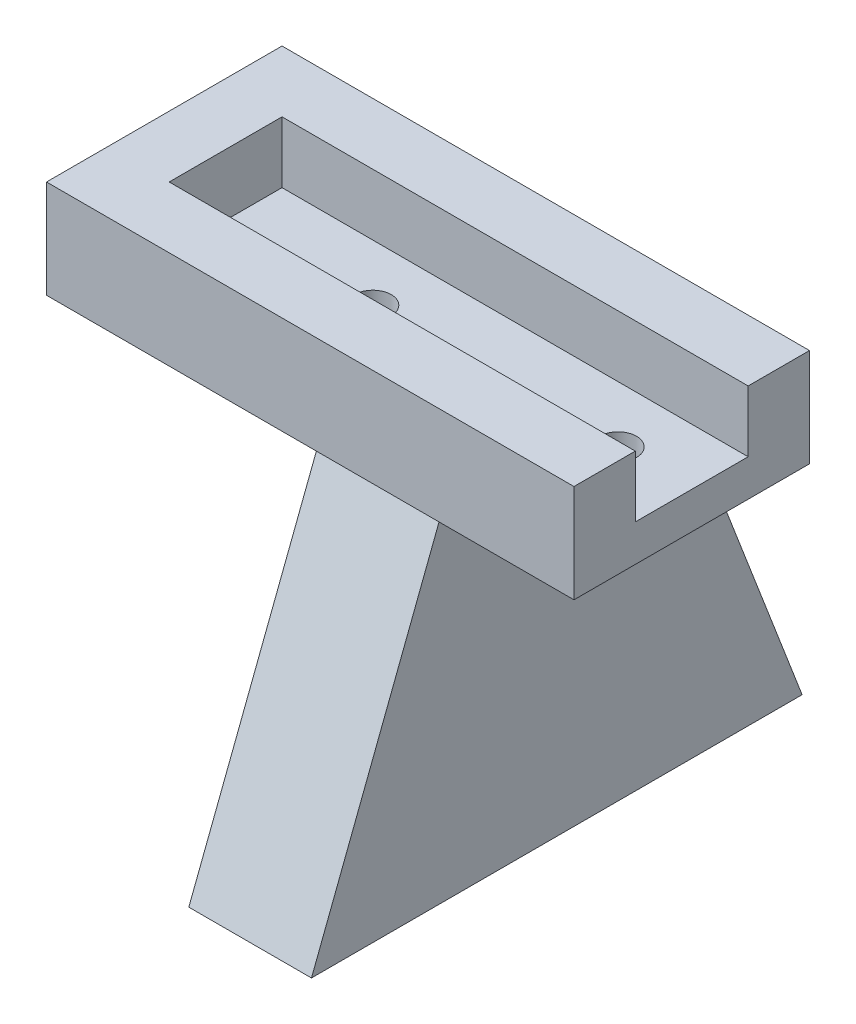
ISO-10303-21;
HEADER;
FILE_DESCRIPTION(('STEP AP214'),'2;1');
FILE_NAME('part.step','',(''),(''),'','','');
FILE_SCHEMA(('AUTOMOTIVE_DESIGN { 1 0 10303 214 1 1 1 1 }'));
ENDSEC;
DATA;
#1=APPLICATION_CONTEXT('core data for automotive mechanical design processes');
#2=APPLICATION_PROTOCOL_DEFINITION('international standard','automotive_design',2000,#1);
#3=PRODUCT_CONTEXT('',#1,'mechanical');
#4=PRODUCT('Part','Part','',(#3));
#5=PRODUCT_RELATED_PRODUCT_CATEGORY('part','',(#4));
#6=PRODUCT_DEFINITION_FORMATION('','',#4);
#7=PRODUCT_DEFINITION_CONTEXT('part definition',#1,'design');
#8=PRODUCT_DEFINITION('design','',#6,#7);
#9=PRODUCT_DEFINITION_SHAPE('','',#8);
#10=(LENGTH_UNIT() NAMED_UNIT(*) SI_UNIT(.MILLI.,.METRE.));
#11=(NAMED_UNIT(*) PLANE_ANGLE_UNIT() SI_UNIT($,.RADIAN.));
#12=(NAMED_UNIT(*) SI_UNIT($,.STERADIAN.) SOLID_ANGLE_UNIT());
#13=UNCERTAINTY_MEASURE_WITH_UNIT(LENGTH_MEASURE(1.E-05),#10,'distance_accuracy_value','');
#14=(GEOMETRIC_REPRESENTATION_CONTEXT(3) GLOBAL_UNCERTAINTY_ASSIGNED_CONTEXT((#13)) GLOBAL_UNIT_ASSIGNED_CONTEXT((#10,
#11,#12)) REPRESENTATION_CONTEXT('',''));
#15=CARTESIAN_POINT('',(0.,0.,0.));
#16=DIRECTION('',(0.,0.,1.));
#17=DIRECTION('',(1.,0.,0.));
#18=AXIS2_PLACEMENT_3D('',#15,#16,#17);
#19=CARTESIAN_POINT('',(-12.,-3.,9.6));
#20=DIRECTION('',(0.,-1.,0.));
#21=DIRECTION('',(0.,0.,-1.));
#22=AXIS2_PLACEMENT_3D('',#19,#20,#21);
#23=PLANE('',#22);
#24=CARTESIAN_POINT('',(0.,-3.,0.));
#25=DIRECTION('',(0.,1.,0.));
#26=DIRECTION('',(0.,0.,1.));
#27=AXIS2_PLACEMENT_3D('',#24,#25,#26);
#28=CIRCLE('',#27,1.5);
#29=CARTESIAN_POINT('',(0.,-3.,1.5));
#30=VERTEX_POINT('',#29);
#31=EDGE_CURVE('E207',#30,#30,#28,.T.);
#32=ORIENTED_EDGE('',*,*,#31,.T.);
#33=EDGE_LOOP('',(#32));
#34=FACE_BOUND('',#33,.T.);
#35=DIRECTION('',(1.,0.,0.));
#36=VECTOR('',#35,1.);
#37=CARTESIAN_POINT('',(-12.,-3.,-9.6));
#38=LINE('',#37,#36);
#39=CARTESIAN_POINT('',(-17.,-3.,-9.6));
#40=VERTEX_POINT('',#39);
#41=CARTESIAN_POINT('',(5.,-3.,-9.6));
#42=VERTEX_POINT('',#41);
#43=EDGE_CURVE('E135',#40,#42,#38,.T.);
#44=ORIENTED_EDGE('',*,*,#43,.T.);
#45=DIRECTION('',(0.,0.,1.));
#46=VECTOR('',#45,1.);
#47=CARTESIAN_POINT('',(5.,-3.,9.6));
#48=LINE('',#47,#46);
#49=CARTESIAN_POINT('',(5.,-3.,9.6));
#50=VERTEX_POINT('',#49);
#51=EDGE_CURVE('E61',#42,#50,#48,.T.);
#52=ORIENTED_EDGE('',*,*,#51,.T.);
#53=DIRECTION('',(1.,0.,0.));
#54=VECTOR('',#53,1.);
#55=CARTESIAN_POINT('',(-12.,-3.,9.6));
#56=LINE('',#55,#54);
#57=CARTESIAN_POINT('',(-17.,-3.,9.6));
#58=VERTEX_POINT('',#57);
#59=EDGE_CURVE('E47',#58,#50,#56,.T.);
#60=ORIENTED_EDGE('',*,*,#59,.F.);
#61=DIRECTION('',(0.,0.,1.));
#62=VECTOR('',#61,1.);
#63=CARTESIAN_POINT('',(-17.,-3.,9.6));
#64=LINE('',#63,#62);
#65=EDGE_CURVE('E147',#40,#58,#64,.T.);
#66=ORIENTED_EDGE('',*,*,#65,.F.);
#67=EDGE_LOOP('',(#44,#52,#60,#66));
#68=FACE_BOUND('',#67,.T.);
#69=ADVANCED_FACE('F43',(#34,#68),#23,.T.);
#70=CARTESIAN_POINT('',(-12.,5.,9.6));
#71=DIRECTION('',(0.,0.,1.));
#72=DIRECTION('',(0.,-1.,0.));
#73=AXIS2_PLACEMENT_3D('',#70,#71,#72);
#74=PLANE('',#73);
#75=ORIENTED_EDGE('',*,*,#59,.T.);
#76=DIRECTION('',(-1.,0.,0.));
#77=VECTOR('',#76,1.);
#78=CARTESIAN_POINT('',(15.,-3.,9.6));
#79=LINE('',#78,#77);
#80=CARTESIAN_POINT('',(15.,-3.,9.6));
#81=VERTEX_POINT('',#80);
#82=EDGE_CURVE('E202',#81,#50,#79,.T.);
#83=ORIENTED_EDGE('',*,*,#82,.F.);
#84=CARTESIAN_POINT('',(26.,-3.,9.6));
#85=VERTEX_POINT('',#84);
#86=EDGE_CURVE('E265',#81,#85,#56,.T.);
#87=ORIENTED_EDGE('',*,*,#86,.T.);
#88=DIRECTION('',(0.,-1.,0.));
#89=VECTOR('',#88,1.);
#90=CARTESIAN_POINT('',(26.,5.,9.6));
#91=LINE('',#90,#89);
#92=CARTESIAN_POINT('',(26.,5.,9.6));
#93=VERTEX_POINT('',#92);
#94=EDGE_CURVE('E222',#93,#85,#91,.T.);
#95=ORIENTED_EDGE('',*,*,#94,.F.);
#96=DIRECTION('',(1.,0.,0.));
#97=VECTOR('',#96,1.);
#98=CARTESIAN_POINT('',(-12.,5.,9.6));
#99=LINE('',#98,#97);
#100=CARTESIAN_POINT('',(-17.,5.,9.6));
#101=VERTEX_POINT('',#100);
#102=EDGE_CURVE('E11',#101,#93,#99,.T.);
#103=ORIENTED_EDGE('',*,*,#102,.F.);
#104=DIRECTION('',(0.,1.,0.));
#105=VECTOR('',#104,1.);
#106=CARTESIAN_POINT('',(-17.,5.,9.6));
#107=LINE('',#106,#105);
#108=EDGE_CURVE('E152',#58,#101,#107,.T.);
#109=ORIENTED_EDGE('',*,*,#108,.F.);
#110=EDGE_LOOP('',(#75,#83,#87,#95,#103,#109));
#111=FACE_BOUND('',#110,.T.);
#112=ADVANCED_FACE('F45',(#111),#74,.T.);
#113=CARTESIAN_POINT('',(-12.,5.,4.6));
#114=DIRECTION('',(0.,1.,0.));
#115=DIRECTION('',(0.,0.,1.));
#116=AXIS2_PLACEMENT_3D('',#113,#114,#115);
#117=PLANE('',#116);
#118=ORIENTED_EDGE('',*,*,#102,.T.);
#119=DIRECTION('',(0.,0.,1.));
#120=VECTOR('',#119,1.);
#121=CARTESIAN_POINT('',(26.,5.,4.6));
#122=LINE('',#121,#120);
#123=CARTESIAN_POINT('',(26.,5.,4.6));
#124=VERTEX_POINT('',#123);
#125=EDGE_CURVE('E250',#124,#93,#122,.T.);
#126=ORIENTED_EDGE('',*,*,#125,.F.);
#127=DIRECTION('',(1.,0.,0.));
#128=VECTOR('',#127,1.);
#129=CARTESIAN_POINT('',(-12.,5.,4.6));
#130=LINE('',#129,#128);
#131=CARTESIAN_POINT('',(-12.,5.,4.6));
#132=VERTEX_POINT('',#131);
#133=EDGE_CURVE('E53',#132,#124,#130,.T.);
#134=ORIENTED_EDGE('',*,*,#133,.F.);
#135=DIRECTION('',(0.,0.,-1.));
#136=VECTOR('',#135,1.);
#137=CARTESIAN_POINT('',(-12.,5.,-9.6));
#138=LINE('',#137,#136);
#139=CARTESIAN_POINT('',(-12.,5.,-4.6));
#140=VERTEX_POINT('',#139);
#141=EDGE_CURVE('E159',#132,#140,#138,.T.);
#142=ORIENTED_EDGE('',*,*,#141,.T.);
#143=DIRECTION('',(1.,0.,0.));
#144=VECTOR('',#143,1.);
#145=CARTESIAN_POINT('',(-12.,5.,-4.6));
#146=LINE('',#145,#144);
#147=CARTESIAN_POINT('',(26.,5.,-4.6));
#148=VERTEX_POINT('',#147);
#149=EDGE_CURVE('E275',#140,#148,#146,.T.);
#150=ORIENTED_EDGE('',*,*,#149,.T.);
#151=DIRECTION('',(0.,0.,1.));
#152=VECTOR('',#151,1.);
#153=CARTESIAN_POINT('',(26.,5.,-4.6));
#154=LINE('',#153,#152);
#155=CARTESIAN_POINT('',(26.,5.,-9.6));
#156=VERTEX_POINT('',#155);
#157=EDGE_CURVE('E234',#156,#148,#154,.T.);
#158=ORIENTED_EDGE('',*,*,#157,.F.);
#159=DIRECTION('',(1.,0.,0.));
#160=VECTOR('',#159,1.);
#161=CARTESIAN_POINT('',(-12.,5.,-9.6));
#162=LINE('',#161,#160);
#163=CARTESIAN_POINT('',(-17.,5.,-9.6));
#164=VERTEX_POINT('',#163);
#165=EDGE_CURVE('E144',#164,#156,#162,.T.);
#166=ORIENTED_EDGE('',*,*,#165,.F.);
#167=DIRECTION('',(0.,0.,-1.));
#168=VECTOR('',#167,1.);
#169=CARTESIAN_POINT('',(-17.,5.,-9.6));
#170=LINE('',#169,#168);
#171=EDGE_CURVE('E157',#101,#164,#170,.T.);
#172=ORIENTED_EDGE('',*,*,#171,.F.);
#173=EDGE_LOOP('',(#118,#126,#134,#142,#150,#158,#166,#172));
#174=FACE_BOUND('',#173,.T.);
#175=ADVANCED_FACE('F286',(#174),#117,.T.);
#176=CARTESIAN_POINT('',(-12.,0.,4.6));
#177=DIRECTION('',(0.,0.,-1.));
#178=DIRECTION('',(-1.,0.,0.));
#179=AXIS2_PLACEMENT_3D('',#176,#177,#178);
#180=PLANE('',#179);
#181=ORIENTED_EDGE('',*,*,#133,.T.);
#182=DIRECTION('',(0.,1.,0.));
#183=VECTOR('',#182,1.);
#184=CARTESIAN_POINT('',(26.,0.,4.6));
#185=LINE('',#184,#183);
#186=CARTESIAN_POINT('',(26.,0.,4.6));
#187=VERTEX_POINT('',#186);
#188=EDGE_CURVE('E246',#187,#124,#185,.T.);
#189=ORIENTED_EDGE('',*,*,#188,.F.);
#190=DIRECTION('',(1.,0.,0.));
#191=VECTOR('',#190,1.);
#192=CARTESIAN_POINT('',(-12.,0.,4.6));
#193=LINE('',#192,#191);
#194=CARTESIAN_POINT('',(-12.,0.,4.6));
#195=VERTEX_POINT('',#194);
#196=EDGE_CURVE('E269',#195,#187,#193,.T.);
#197=ORIENTED_EDGE('',*,*,#196,.F.);
#198=DIRECTION('',(0.,1.,0.));
#199=VECTOR('',#198,1.);
#200=CARTESIAN_POINT('',(-12.,0.,4.6));
#201=LINE('',#200,#199);
#202=EDGE_CURVE('E262',#195,#132,#201,.T.);
#203=ORIENTED_EDGE('',*,*,#202,.T.);
#204=EDGE_LOOP('',(#181,#189,#197,#203));
#205=FACE_BOUND('',#204,.T.);
#206=ADVANCED_FACE('F298',(#205),#180,.T.);
#207=CARTESIAN_POINT('',(-12.,0.,4.6));
#208=DIRECTION('',(0.,1.,0.));
#209=DIRECTION('',(0.,0.,1.));
#210=AXIS2_PLACEMENT_3D('',#207,#208,#209);
#211=PLANE('',#210);
#212=CARTESIAN_POINT('',(0.,0.,0.));
#213=DIRECTION('',(0.,1.,0.));
#214=DIRECTION('',(0.,0.,1.));
#215=AXIS2_PLACEMENT_3D('',#212,#213,#214);
#216=CIRCLE('',#215,1.5);
#217=CARTESIAN_POINT('',(0.,0.,1.5));
#218=VERTEX_POINT('',#217);
#219=EDGE_CURVE('E218',#218,#218,#216,.T.);
#220=ORIENTED_EDGE('',*,*,#219,.F.);
#221=EDGE_LOOP('',(#220));
#222=FACE_BOUND('',#221,.T.);
#223=CARTESIAN_POINT('',(20.,0.,0.));
#224=DIRECTION('',(0.,1.,0.));
#225=DIRECTION('',(0.,0.,1.));
#226=AXIS2_PLACEMENT_3D('',#223,#224,#225);
#227=CIRCLE('',#226,1.5);
#228=CARTESIAN_POINT('',(20.,0.,1.5));
#229=VERTEX_POINT('',#228);
#230=EDGE_CURVE('E211',#229,#229,#227,.T.);
#231=ORIENTED_EDGE('',*,*,#230,.F.);
#232=EDGE_LOOP('',(#231));
#233=FACE_BOUND('',#232,.T.);
#234=ORIENTED_EDGE('',*,*,#196,.T.);
#235=DIRECTION('',(0.,0.,1.));
#236=VECTOR('',#235,1.);
#237=CARTESIAN_POINT('',(26.,0.,4.6));
#238=LINE('',#237,#236);
#239=CARTESIAN_POINT('',(26.,0.,-4.6));
#240=VERTEX_POINT('',#239);
#241=EDGE_CURVE('E242',#240,#187,#238,.T.);
#242=ORIENTED_EDGE('',*,*,#241,.F.);
#243=DIRECTION('',(1.,0.,0.));
#244=VECTOR('',#243,1.);
#245=CARTESIAN_POINT('',(-12.,0.,-4.6));
#246=LINE('',#245,#244);
#247=CARTESIAN_POINT('',(-12.,0.,-4.6));
#248=VERTEX_POINT('',#247);
#249=EDGE_CURVE('E272',#248,#240,#246,.T.);
#250=ORIENTED_EDGE('',*,*,#249,.F.);
#251=DIRECTION('',(0.,0.,1.));
#252=VECTOR('',#251,1.);
#253=CARTESIAN_POINT('',(-12.,0.,4.6));
#254=LINE('',#253,#252);
#255=EDGE_CURVE('E258',#248,#195,#254,.T.);
#256=ORIENTED_EDGE('',*,*,#255,.T.);
#257=EDGE_LOOP('',(#234,#242,#250,#256));
#258=FACE_BOUND('',#257,.T.);
#259=ADVANCED_FACE('F295',(#222,#233,#258),#211,.T.);
#260=CARTESIAN_POINT('',(-12.,0.,-4.6));
#261=DIRECTION('',(0.,0.,1.));
#262=DIRECTION('',(1.,0.,0.));
#263=AXIS2_PLACEMENT_3D('',#260,#261,#262);
#264=PLANE('',#263);
#265=ORIENTED_EDGE('',*,*,#249,.T.);
#266=DIRECTION('',(0.,-1.,0.));
#267=VECTOR('',#266,1.);
#268=CARTESIAN_POINT('',(26.,0.,-4.6));
#269=LINE('',#268,#267);
#270=EDGE_CURVE('E238',#148,#240,#269,.T.);
#271=ORIENTED_EDGE('',*,*,#270,.F.);
#272=ORIENTED_EDGE('',*,*,#149,.F.);
#273=DIRECTION('',(0.,-1.,0.));
#274=VECTOR('',#273,1.);
#275=CARTESIAN_POINT('',(-12.,0.,-4.6));
#276=LINE('',#275,#274);
#277=EDGE_CURVE('E254',#140,#248,#276,.T.);
#278=ORIENTED_EDGE('',*,*,#277,.T.);
#279=EDGE_LOOP('',(#265,#271,#272,#278));
#280=FACE_BOUND('',#279,.T.);
#281=ADVANCED_FACE('F290',(#280),#264,.T.);
#282=CARTESIAN_POINT('',(-12.,-3.,-9.6));
#283=DIRECTION('',(0.,0.,-1.));
#284=DIRECTION('',(-1.,0.,0.));
#285=AXIS2_PLACEMENT_3D('',#282,#283,#284);
#286=PLANE('',#285);
#287=ORIENTED_EDGE('',*,*,#165,.T.);
#288=DIRECTION('',(0.,1.,0.));
#289=VECTOR('',#288,1.);
#290=CARTESIAN_POINT('',(26.,-3.,-9.6));
#291=LINE('',#290,#289);
#292=CARTESIAN_POINT('',(26.,-3.,-9.6));
#293=VERTEX_POINT('',#292);
#294=EDGE_CURVE('E230',#293,#156,#291,.T.);
#295=ORIENTED_EDGE('',*,*,#294,.F.);
#296=CARTESIAN_POINT('',(15.,-3.,-9.6));
#297=VERTEX_POINT('',#296);
#298=EDGE_CURVE('E145',#297,#293,#38,.T.);
#299=ORIENTED_EDGE('',*,*,#298,.F.);
#300=DIRECTION('',(-1.,0.,0.));
#301=VECTOR('',#300,1.);
#302=CARTESIAN_POINT('',(15.,-3.,-9.6));
#303=LINE('',#302,#301);
#304=EDGE_CURVE('E141',#297,#42,#303,.T.);
#305=ORIENTED_EDGE('',*,*,#304,.T.);
#306=ORIENTED_EDGE('',*,*,#43,.F.);
#307=DIRECTION('',(0.,-1.,0.));
#308=VECTOR('',#307,1.);
#309=CARTESIAN_POINT('',(-17.,-3.,-9.6));
#310=LINE('',#309,#308);
#311=EDGE_CURVE('E139',#164,#40,#310,.T.);
#312=ORIENTED_EDGE('',*,*,#311,.F.);
#313=EDGE_LOOP('',(#287,#295,#299,#305,#306,#312));
#314=FACE_BOUND('',#313,.T.);
#315=ADVANCED_FACE('F137',(#314),#286,.T.);
#316=DIRECTION('',(0.,0.,1.));
#317=VECTOR('',#316,1.);
#318=CARTESIAN_POINT('',(15.,-3.,9.6));
#319=LINE('',#318,#317);
#320=EDGE_CURVE('E69',#297,#81,#319,.T.);
#321=ORIENTED_EDGE('',*,*,#320,.F.);
#322=ORIENTED_EDGE('',*,*,#298,.T.);
#323=DIRECTION('',(0.,0.,-1.));
#324=VECTOR('',#323,1.);
#325=CARTESIAN_POINT('',(26.,-3.,9.6));
#326=LINE('',#325,#324);
#327=EDGE_CURVE('E226',#85,#293,#326,.T.);
#328=ORIENTED_EDGE('',*,*,#327,.F.);
#329=ORIENTED_EDGE('',*,*,#86,.F.);
#330=EDGE_LOOP('',(#321,#322,#328,#329));
#331=FACE_BOUND('',#330,.T.);
#332=CARTESIAN_POINT('',(20.,-3.,0.));
#333=DIRECTION('',(0.,1.,0.));
#334=DIRECTION('',(0.,0.,1.));
#335=AXIS2_PLACEMENT_3D('',#332,#333,#334);
#336=CIRCLE('',#335,1.5);
#337=CARTESIAN_POINT('',(20.,-3.,1.5));
#338=VERTEX_POINT('',#337);
#339=EDGE_CURVE('E206',#338,#338,#336,.T.);
#340=ORIENTED_EDGE('',*,*,#339,.T.);
#341=EDGE_LOOP('',(#340));
#342=FACE_BOUND('',#341,.T.);
#343=ADVANCED_FACE('F304',(#331,#342),#23,.T.);
#344=CARTESIAN_POINT('',(26.,0.,0.));
#345=DIRECTION('',(1.,0.,0.));
#346=DIRECTION('',(0.,0.,-1.));
#347=AXIS2_PLACEMENT_3D('',#344,#345,#346);
#348=PLANE('',#347);
#349=ORIENTED_EDGE('',*,*,#94,.T.);
#350=ORIENTED_EDGE('',*,*,#327,.T.);
#351=ORIENTED_EDGE('',*,*,#294,.T.);
#352=ORIENTED_EDGE('',*,*,#157,.T.);
#353=ORIENTED_EDGE('',*,*,#270,.T.);
#354=ORIENTED_EDGE('',*,*,#241,.T.);
#355=ORIENTED_EDGE('',*,*,#188,.T.);
#356=ORIENTED_EDGE('',*,*,#125,.T.);
#357=EDGE_LOOP('',(#349,#350,#351,#352,#353,#354,#355,#356));
#358=FACE_BOUND('',#357,.T.);
#359=ADVANCED_FACE('F283',(#358),#348,.T.);
#360=CARTESIAN_POINT('',(20.,-3.,0.));
#361=DIRECTION('',(0.,1.,0.));
#362=DIRECTION('',(0.,0.,1.));
#363=AXIS2_PLACEMENT_3D('',#360,#361,#362);
#364=CYLINDRICAL_SURFACE('',#363,1.5);
#365=ORIENTED_EDGE('',*,*,#230,.T.);
#366=EDGE_LOOP('',(#365));
#367=FACE_BOUND('',#366,.T.);
#368=ORIENTED_EDGE('',*,*,#339,.F.);
#369=EDGE_LOOP('',(#368));
#370=FACE_BOUND('',#369,.T.);
#371=ADVANCED_FACE('F345',(#367,#370),#364,.F.);
#372=CARTESIAN_POINT('',(0.,-3.,0.));
#373=DIRECTION('',(0.,1.,0.));
#374=DIRECTION('',(0.,0.,1.));
#375=AXIS2_PLACEMENT_3D('',#372,#373,#374);
#376=CYLINDRICAL_SURFACE('',#375,1.5);
#377=ORIENTED_EDGE('',*,*,#219,.T.);
#378=EDGE_LOOP('',(#377));
#379=FACE_BOUND('',#378,.T.);
#380=ORIENTED_EDGE('',*,*,#31,.F.);
#381=EDGE_LOOP('',(#380));
#382=FACE_BOUND('',#381,.T.);
#383=ADVANCED_FACE('F332',(#379,#382),#376,.F.);
#384=CARTESIAN_POINT('',(15.,-30.,20.));
#385=DIRECTION('',(0.,-0.359442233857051,-0.933167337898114));
#386=DIRECTION('',(0.,0.933167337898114,-0.359442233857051));
#387=AXIS2_PLACEMENT_3D('',#384,#385,#386);
#388=PLANE('',#387);
#389=DIRECTION('',(0.,-0.933167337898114,0.359442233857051));
#390=VECTOR('',#389,1.);
#391=CARTESIAN_POINT('',(5.,-30.,20.));
#392=LINE('',#391,#390);
#393=CARTESIAN_POINT('',(5.,-30.,20.));
#394=VERTEX_POINT('',#393);
#395=EDGE_CURVE('E184',#50,#394,#392,.T.);
#396=ORIENTED_EDGE('',*,*,#395,.T.);
#397=DIRECTION('',(-1.,0.,0.));
#398=VECTOR('',#397,1.);
#399=CARTESIAN_POINT('',(15.,-30.,20.));
#400=LINE('',#399,#398);
#401=CARTESIAN_POINT('',(15.,-30.,20.));
#402=VERTEX_POINT('',#401);
#403=EDGE_CURVE('E198',#402,#394,#400,.T.);
#404=ORIENTED_EDGE('',*,*,#403,.F.);
#405=DIRECTION('',(0.,-0.933167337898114,0.359442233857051));
#406=VECTOR('',#405,1.);
#407=CARTESIAN_POINT('',(15.,-30.,20.));
#408=LINE('',#407,#406);
#409=EDGE_CURVE('E171',#81,#402,#408,.T.);
#410=ORIENTED_EDGE('',*,*,#409,.F.);
#411=ORIENTED_EDGE('',*,*,#82,.T.);
#412=EDGE_LOOP('',(#396,#404,#410,#411));
#413=FACE_BOUND('',#412,.T.);
#414=ADVANCED_FACE('F315',(#413),#388,.F.);
#415=CARTESIAN_POINT('',(15.,-30.,20.));
#416=DIRECTION('',(0.,1.,0.));
#417=DIRECTION('',(0.,0.,1.));
#418=AXIS2_PLACEMENT_3D('',#415,#416,#417);
#419=PLANE('',#418);
#420=DIRECTION('',(0.,0.,-1.));
#421=VECTOR('',#420,1.);
#422=CARTESIAN_POINT('',(5.,-30.,20.));
#423=LINE('',#422,#421);
#424=CARTESIAN_POINT('',(5.,-30.,-20.));
#425=VERTEX_POINT('',#424);
#426=EDGE_CURVE('E187',#394,#425,#423,.T.);
#427=ORIENTED_EDGE('',*,*,#426,.T.);
#428=DIRECTION('',(-1.,0.,0.));
#429=VECTOR('',#428,1.);
#430=CARTESIAN_POINT('',(15.,-30.,-20.));
#431=LINE('',#430,#429);
#432=CARTESIAN_POINT('',(15.,-30.,-20.));
#433=VERTEX_POINT('',#432);
#434=EDGE_CURVE('E194',#433,#425,#431,.T.);
#435=ORIENTED_EDGE('',*,*,#434,.F.);
#436=DIRECTION('',(0.,0.,-1.));
#437=VECTOR('',#436,1.);
#438=CARTESIAN_POINT('',(15.,-30.,20.));
#439=LINE('',#438,#437);
#440=EDGE_CURVE('E175',#402,#433,#439,.T.);
#441=ORIENTED_EDGE('',*,*,#440,.F.);
#442=ORIENTED_EDGE('',*,*,#403,.T.);
#443=EDGE_LOOP('',(#427,#435,#441,#442));
#444=FACE_BOUND('',#443,.T.);
#445=ADVANCED_FACE('F324',(#444),#419,.F.);
#446=CARTESIAN_POINT('',(15.,-30.,-20.));
#447=DIRECTION('',(0.,-0.359442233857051,0.933167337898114));
#448=DIRECTION('',(0.,-0.933167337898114,-0.359442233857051));
#449=AXIS2_PLACEMENT_3D('',#446,#447,#448);
#450=PLANE('',#449);
#451=DIRECTION('',(0.,0.933167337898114,0.359442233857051));
#452=VECTOR('',#451,1.);
#453=CARTESIAN_POINT('',(5.,-30.,-20.));
#454=LINE('',#453,#452);
#455=EDGE_CURVE('E172',#425,#42,#454,.T.);
#456=ORIENTED_EDGE('',*,*,#455,.T.);
#457=ORIENTED_EDGE('',*,*,#304,.F.);
#458=DIRECTION('',(0.,0.933167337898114,0.359442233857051));
#459=VECTOR('',#458,1.);
#460=CARTESIAN_POINT('',(15.,-30.,-20.));
#461=LINE('',#460,#459);
#462=EDGE_CURVE('E178',#433,#297,#461,.T.);
#463=ORIENTED_EDGE('',*,*,#462,.F.);
#464=ORIENTED_EDGE('',*,*,#434,.T.);
#465=EDGE_LOOP('',(#456,#457,#463,#464));
#466=FACE_BOUND('',#465,.T.);
#467=ADVANCED_FACE('F322',(#466),#450,.F.);
#468=CARTESIAN_POINT('',(15.,0.,0.));
#469=DIRECTION('',(1.,0.,0.));
#470=DIRECTION('',(0.,0.,-1.));
#471=AXIS2_PLACEMENT_3D('',#468,#469,#470);
#472=PLANE('',#471);
#473=ORIENTED_EDGE('',*,*,#320,.T.);
#474=ORIENTED_EDGE('',*,*,#409,.T.);
#475=ORIENTED_EDGE('',*,*,#440,.T.);
#476=ORIENTED_EDGE('',*,*,#462,.T.);
#477=EDGE_LOOP('',(#473,#474,#475,#476));
#478=FACE_BOUND('',#477,.T.);
#479=ADVANCED_FACE('F318',(#478),#472,.T.);
#480=CARTESIAN_POINT('',(5.,0.,0.));
#481=DIRECTION('',(1.,0.,0.));
#482=DIRECTION('',(0.,0.,-1.));
#483=AXIS2_PLACEMENT_3D('',#480,#481,#482);
#484=PLANE('',#483);
#485=ORIENTED_EDGE('',*,*,#51,.F.);
#486=ORIENTED_EDGE('',*,*,#455,.F.);
#487=ORIENTED_EDGE('',*,*,#426,.F.);
#488=ORIENTED_EDGE('',*,*,#395,.F.);
#489=EDGE_LOOP('',(#485,#486,#487,#488));
#490=FACE_BOUND('',#489,.T.);
#491=ADVANCED_FACE('F311',(#490),#484,.F.);
#492=CARTESIAN_POINT('',(-12.,0.,0.));
#493=DIRECTION('',(1.,0.,0.));
#494=DIRECTION('',(0.,0.,-1.));
#495=AXIS2_PLACEMENT_3D('',#492,#493,#494);
#496=PLANE('',#495);
#497=ORIENTED_EDGE('',*,*,#202,.F.);
#498=ORIENTED_EDGE('',*,*,#255,.F.);
#499=ORIENTED_EDGE('',*,*,#277,.F.);
#500=ORIENTED_EDGE('',*,*,#141,.F.);
#501=EDGE_LOOP('',(#497,#498,#499,#500));
#502=FACE_BOUND('',#501,.T.);
#503=ADVANCED_FACE('F412',(#502),#496,.T.);
#504=CARTESIAN_POINT('',(-17.,0.,0.));
#505=DIRECTION('',(1.,0.,0.));
#506=DIRECTION('',(0.,0.,-1.));
#507=AXIS2_PLACEMENT_3D('',#504,#505,#506);
#508=PLANE('',#507);
#509=ORIENTED_EDGE('',*,*,#311,.T.);
#510=ORIENTED_EDGE('',*,*,#65,.T.);
#511=ORIENTED_EDGE('',*,*,#108,.T.);
#512=ORIENTED_EDGE('',*,*,#171,.T.);
#513=EDGE_LOOP('',(#509,#510,#511,#512));
#514=FACE_BOUND('',#513,.T.);
#515=ADVANCED_FACE('F155',(#514),#508,.F.);
#516=CLOSED_SHELL('',(#69,#112,#175,#206,#259,#281,#315,#343,#359,#371,#383,#414,#445,#467,#479,
#491,#503,#515));
#517=MANIFOLD_SOLID_BREP('B2',#516);
#518=ADVANCED_BREP_SHAPE_REPRESENTATION('',(#18,#517),#14);
#519=SHAPE_DEFINITION_REPRESENTATION(#9,#518);
ENDSEC;
END-ISO-10303-21;
